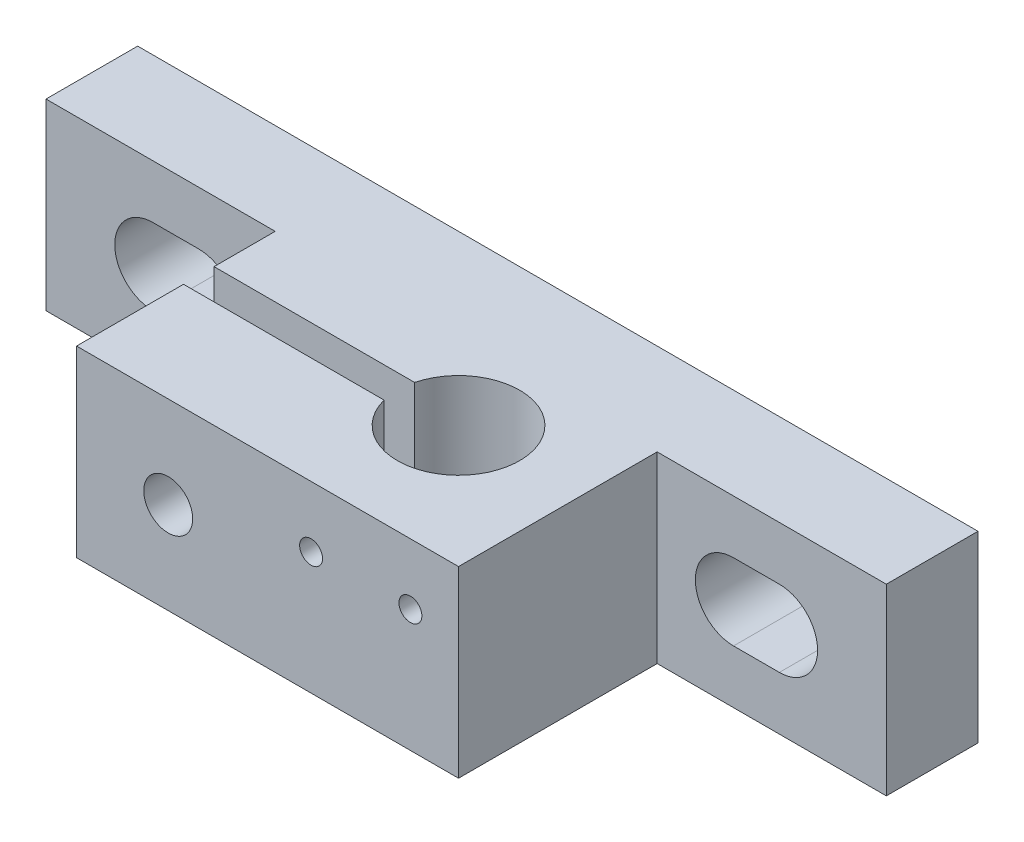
from build123d import *

# Parameters (mm, degrees)
SKETCH2_W           = 55
SKETCH2_H           = 12
BOSS_EXTRUDE1_DEPTH = 6
SKETCH3_W           = 25
SKETCH3_H           = 12
BOSS_EXTRUDE2_DEPTH = 13
SKETCH4_R           = 4
CUT_EXTRUDE2_DEPTH  = 30
SKETCH5_W           = 20.513890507
SKETCH5_H           = 7
CUT_EXTRUDE3_DEPTH  = 5
SKETCH6_R           = 1.6
CUT_EXTRUDE4_DEPTH  = 20
CUT_EXTRUDE5_DEPTH  = 3
SKETCH8_R           = 0.75
CUT_EXTRUDE6_DEPTH  = 3


with BuildPart() as part:
    # Sketch2 → Boss-Extrude1 (new body)
    with BuildSketch(Plane.XY):
        with Locations((27.5, 6)):
            Rectangle(SKETCH2_W, SKETCH2_H)
        with BuildLine():
            Line((7, 8.5), (10, 8.5))
            ThreePointArc((10, 8.5), (12.5, 6), (10, 3.5))
            Line((10, 3.5), (7, 3.5))
            ThreePointArc((7, 3.5), (4.5, 6), (7, 8.5))
        make_face(mode=Mode.SUBTRACT)
        with BuildLine():
            Line((48, 8.5), (45, 8.5))
            ThreePointArc((45, 8.5), (42.5, 6), (45, 3.5))
            Line((45, 3.5), (48, 3.5))
            ThreePointArc((48, 3.5), (50.5, 6), (48, 8.5))
        make_face(mode=Mode.SUBTRACT)
    extrude(amount=BOSS_EXTRUDE1_DEPTH)

    # Sketch3 → Boss-Extrude2 (add)
    with BuildSketch(Plane.XY.offset(6)):
        with Locations((27.5, 6)):
            Rectangle(SKETCH3_W, SKETCH3_H)
    extrude(amount=BOSS_EXTRUDE2_DEPTH)

    # Sketch4 → Cut-Extrude2 (cut)
    with BuildSketch(Plane.XZ):
        with BuildLine():
            ThreePointArc((28.127016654, 10), (28, 11), (28.127016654, 12))
            Line((28.127016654, 12), (15, 12))
            Line((15, 12), (15, 10))
            Line((15, 10), (28.127016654, 10))
        make_face()
        with Locations((32, 11)):
            Circle(SKETCH4_R)
    extrude(amount=-CUT_EXTRUDE2_DEPTH, mode=Mode.SUBTRACT)

    # Sketch5 → Cut-Extrude3 (cut)
    with BuildSketch(Plane(origin=(0, 0, 0), x_dir=(-1, 0, 0), z_dir=(0, 0, -1))):
        with Locations((-27.415473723, 6)):
            Rectangle(SKETCH5_W, SKETCH5_H)
    extrude(amount=-CUT_EXTRUDE3_DEPTH, mode=Mode.SUBTRACT)

    # Sketch6 → Cut-Extrude4 (cut)
    with BuildSketch(Plane.XY.offset(19)):
        with Locations(Location((21, 6, 0), (0, 0, 180))):
            Circle(SKETCH6_R)
    extrude(amount=-CUT_EXTRUDE4_DEPTH, mode=Mode.SUBTRACT)

    # Sketch7 → Cut-Extrude5 (cut)
    with BuildSketch(Plane(origin=(0, 0, 5), x_dir=(-1, 0, 0), z_dir=(0, 0, -1))):
        Polygon((-17.535898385, 6), (-19.267949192, 9), (-22.732050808, 9), (-24.464101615, 6), (-22.732050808, 3), (-19.267949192, 3), align=None)
    extrude(amount=-CUT_EXTRUDE5_DEPTH, mode=Mode.SUBTRACT)

    # Sketch8 → Cut-Extrude6 (cut)
    with BuildSketch(Plane.XY.offset(19)):
        with Locations((36.85, 8)):
            Circle(SKETCH8_R)
        with Locations((30.35, 8)):
            Circle(SKETCH8_R)
    extrude(amount=-CUT_EXTRUDE6_DEPTH, mode=Mode.SUBTRACT)


solid = part.part
